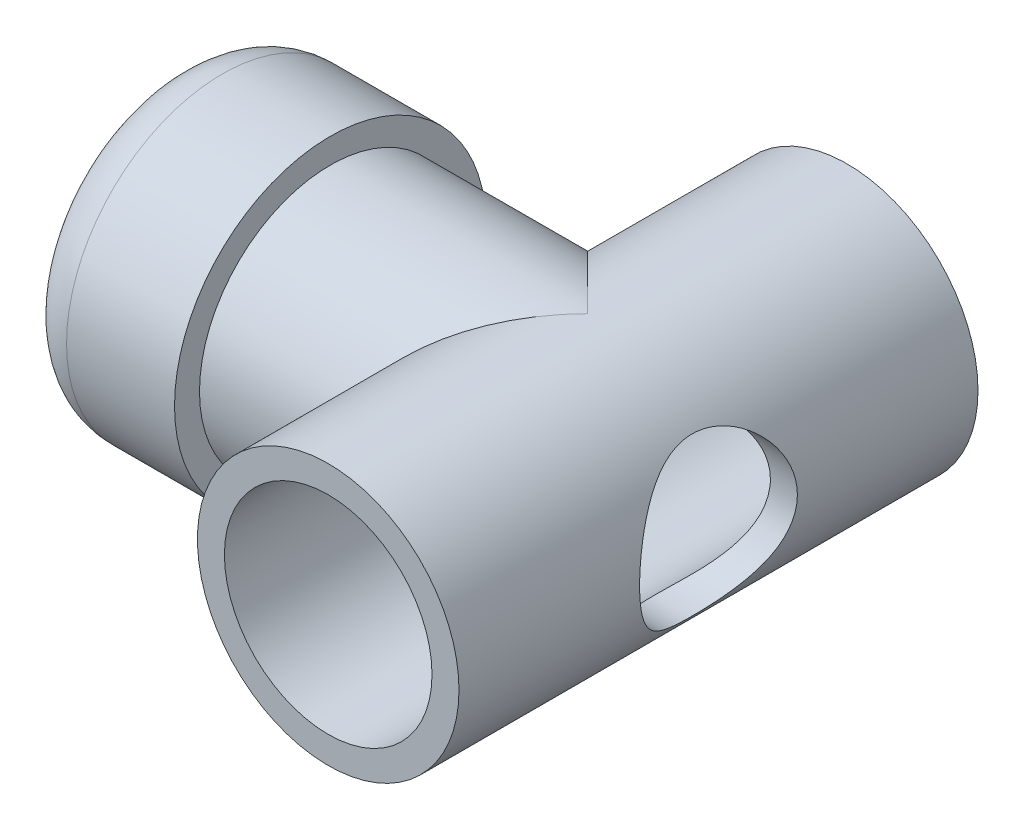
ISO-10303-21;
HEADER;
FILE_DESCRIPTION(('STEP AP214'),'2;1');
FILE_NAME('part.step','',(''),(''),'','','');
FILE_SCHEMA(('AUTOMOTIVE_DESIGN { 1 0 10303 214 1 1 1 1 }'));
ENDSEC;
DATA;
#1=APPLICATION_CONTEXT('core data for automotive mechanical design processes');
#2=APPLICATION_PROTOCOL_DEFINITION('international standard','automotive_design',2000,#1);
#3=PRODUCT_CONTEXT('',#1,'mechanical');
#4=PRODUCT('Part','Part','',(#3));
#5=PRODUCT_RELATED_PRODUCT_CATEGORY('part','',(#4));
#6=PRODUCT_DEFINITION_FORMATION('','',#4);
#7=PRODUCT_DEFINITION_CONTEXT('part definition',#1,'design');
#8=PRODUCT_DEFINITION('design','',#6,#7);
#9=PRODUCT_DEFINITION_SHAPE('','',#8);
#10=(LENGTH_UNIT() NAMED_UNIT(*) SI_UNIT(.MILLI.,.METRE.));
#11=(NAMED_UNIT(*) PLANE_ANGLE_UNIT() SI_UNIT($,.RADIAN.));
#12=(NAMED_UNIT(*) SI_UNIT($,.STERADIAN.) SOLID_ANGLE_UNIT());
#13=UNCERTAINTY_MEASURE_WITH_UNIT(LENGTH_MEASURE(1.E-05),#10,'distance_accuracy_value','');
#14=(GEOMETRIC_REPRESENTATION_CONTEXT(3) GLOBAL_UNCERTAINTY_ASSIGNED_CONTEXT((#13)) GLOBAL_UNIT_ASSIGNED_CONTEXT((#10,
#11,#12)) REPRESENTATION_CONTEXT('',''));
#15=CARTESIAN_POINT('',(0.,0.,0.));
#16=DIRECTION('',(0.,0.,1.));
#17=DIRECTION('',(1.,0.,0.));
#18=AXIS2_PLACEMENT_3D('',#15,#16,#17);
#19=CARTESIAN_POINT('',(-12.7,0.,0.));
#20=DIRECTION('',(1.,0.,0.));
#21=DIRECTION('',(0.,0.,-1.));
#22=AXIS2_PLACEMENT_3D('',#19,#20,#21);
#23=CYLINDRICAL_SURFACE('',#22,4.0005);
#24=CARTESIAN_POINT('',(0.,0.,0.));
#25=DIRECTION('',(0.707106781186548,0.,-0.707106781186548));
#26=DIRECTION('',(-0.707106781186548,0.,-0.707106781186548));
#27=AXIS2_PLACEMENT_3D('',#24,#25,#26);
#28=ELLIPSE('',#27,5.65756135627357,4.0005);
#29=CARTESIAN_POINT('',(0.,-4.0005,0.));
#30=VERTEX_POINT('',#29);
#31=CARTESIAN_POINT('',(0.,4.0005,0.));
#32=VERTEX_POINT('',#31);
#33=EDGE_CURVE('E45',#30,#32,#28,.T.);
#34=ORIENTED_EDGE('',*,*,#33,.F.);
#35=CARTESIAN_POINT('',(0.,0.,0.));
#36=DIRECTION('',(-0.707106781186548,0.,-0.707106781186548));
#37=DIRECTION('',(0.707106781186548,0.,-0.707106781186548));
#38=AXIS2_PLACEMENT_3D('',#35,#36,#37);
#39=ELLIPSE('',#38,5.65756135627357,4.0005);
#40=EDGE_CURVE('E47',#32,#30,#39,.F.);
#41=ORIENTED_EDGE('',*,*,#40,.F.);
#42=EDGE_LOOP('',(#34,#41));
#43=FACE_BOUND('',#42,.T.);
#44=CARTESIAN_POINT('',(-7.874,0.,0.));
#45=DIRECTION('',(-1.,0.,0.));
#46=DIRECTION('',(0.,0.,1.));
#47=AXIS2_PLACEMENT_3D('',#44,#45,#46);
#48=CIRCLE('',#47,4.0005);
#49=CARTESIAN_POINT('',(-7.874,0.,4.0005));
#50=VERTEX_POINT('',#49);
#51=EDGE_CURVE('E199',#50,#50,#48,.F.);
#52=ORIENTED_EDGE('',*,*,#51,.T.);
#53=EDGE_LOOP('',(#52));
#54=FACE_BOUND('',#53,.T.);
#55=ADVANCED_FACE('F30',(#43,#54),#23,.T.);
#56=CARTESIAN_POINT('',(0.,0.,7.9375));
#57=DIRECTION('',(0.,0.,-1.));
#58=DIRECTION('',(-1.,0.,0.));
#59=AXIS2_PLACEMENT_3D('',#56,#57,#58);
#60=CYLINDRICAL_SURFACE('',#59,4.0005);
#61=CARTESIAN_POINT('',(4.0005,0.,2.413));
#62=CARTESIAN_POINT('',(4.00049258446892,0.123325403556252,2.41299182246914));
#63=CARTESIAN_POINT('',(3.9947349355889,0.24684609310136,2.40347883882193));
#64=CARTESIAN_POINT('',(3.97224832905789,0.490160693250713,2.36591287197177));
#65=CARTESIAN_POINT('',(3.95549306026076,0.609944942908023,2.33781542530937));
#66=CARTESIAN_POINT('',(3.9127073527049,0.841751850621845,2.26466790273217));
#67=CARTESIAN_POINT('',(3.88672293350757,0.953809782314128,2.21970187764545));
#68=CARTESIAN_POINT('',(3.82768476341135,1.16843310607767,2.11462172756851));
#69=CARTESIAN_POINT('',(3.79463264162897,1.27100067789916,2.0545110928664));
#70=CARTESIAN_POINT('',(3.72124261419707,1.47266162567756,1.91571258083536));
#71=CARTESIAN_POINT('',(3.6805398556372,1.57088099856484,1.83595144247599));
#72=CARTESIAN_POINT('',(3.59717609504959,1.75340112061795,1.66253743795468));
#73=CARTESIAN_POINT('',(3.55451261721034,1.83768361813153,1.56886665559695));
#74=CARTESIAN_POINT('',(3.46574296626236,2.00056161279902,1.35660709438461));
#75=CARTESIAN_POINT('',(3.41986743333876,2.07715025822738,1.2363684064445));
#76=CARTESIAN_POINT('',(3.33639033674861,2.20875476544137,0.982030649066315));
#77=CARTESIAN_POINT('',(3.2987753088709,2.26380584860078,0.847954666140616));
#78=CARTESIAN_POINT('',(3.24569366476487,2.33902848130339,0.603063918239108));
#79=CARTESIAN_POINT('',(3.22706326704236,2.36443104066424,0.494544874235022));
#80=CARTESIAN_POINT('',(3.20069477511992,2.4000130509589,0.273796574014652));
#81=CARTESIAN_POINT('',(3.19294291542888,2.41021174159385,0.161572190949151));
#82=CARTESIAN_POINT('',(3.18947978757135,2.41479410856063,-0.0636201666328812));
#83=CARTESIAN_POINT('',(3.19379306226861,2.40914554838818,-0.176589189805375));
#84=CARTESIAN_POINT('',(3.21384193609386,2.38232757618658,-0.399658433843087));
#85=CARTESIAN_POINT('',(3.2295862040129,2.36114638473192,-0.509756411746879));
#86=CARTESIAN_POINT('',(3.27002066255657,2.30480607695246,-0.722787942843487));
#87=CARTESIAN_POINT('',(3.29458185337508,2.26984784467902,-0.825800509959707));
#88=CARTESIAN_POINT('',(3.34998792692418,2.18724688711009,-1.02476225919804));
#89=CARTESIAN_POINT('',(3.38083510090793,2.13959953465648,-1.12070884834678));
#90=CARTESIAN_POINT('',(3.45191363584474,2.02329181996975,-1.32079978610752));
#91=CARTESIAN_POINT('',(3.49284049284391,1.95240739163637,-1.42340458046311));
#92=CARTESIAN_POINT('',(3.57580555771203,1.79595812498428,-1.61633750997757));
#93=CARTESIAN_POINT('',(3.61784480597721,1.71037910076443,-1.70665362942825));
#94=CARTESIAN_POINT('',(3.70534621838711,1.51252036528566,-1.88549199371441));
#95=CARTESIAN_POINT('',(3.7504429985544,1.39817373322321,-1.97192627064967));
#96=CARTESIAN_POINT('',(3.83267466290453,1.15375252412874,-2.1241631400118));
#97=CARTESIAN_POINT('',(3.86981368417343,1.02368617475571,-2.18997646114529));
#98=CARTESIAN_POINT('',(3.91532291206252,0.823756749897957,-2.26908238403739));
#99=CARTESIAN_POINT('',(3.92850401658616,0.758552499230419,-2.29171713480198));
#100=CARTESIAN_POINT('',(3.95179709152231,0.625952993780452,-2.3314225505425));
#101=CARTESIAN_POINT('',(3.96191078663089,0.558558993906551,-2.34849634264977));
#102=CARTESIAN_POINT('',(3.97875267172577,0.422188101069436,-2.37679847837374));
#103=CARTESIAN_POINT('',(3.98548340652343,0.353212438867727,-2.38803121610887));
#104=CARTESIAN_POINT('',(3.99536300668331,0.214318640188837,-2.40448216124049));
#105=CARTESIAN_POINT('',(3.99851238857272,0.144400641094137,-2.40970123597));
#106=CARTESIAN_POINT('',(4.00204508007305,-0.046450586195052,-2.41556716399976));
#107=CARTESIAN_POINT('',(3.998781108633,-0.167711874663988,-2.41017825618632));
#108=CARTESIAN_POINT('',(3.98153577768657,-0.407217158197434,-2.38145326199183));
#109=CARTESIAN_POINT('',(3.96755469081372,-0.525461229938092,-2.35811763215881));
#110=CARTESIAN_POINT('',(3.93068422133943,-0.752753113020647,-2.29553185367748));
#111=CARTESIAN_POINT('',(3.90803647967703,-0.861960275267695,-2.25671227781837));
#112=CARTESIAN_POINT('',(3.85564482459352,-1.07227177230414,-2.1647153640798));
#113=CARTESIAN_POINT('',(3.82589954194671,-1.17337453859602,-2.11153525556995));
#114=CARTESIAN_POINT('',(3.75810398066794,-1.37593938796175,-1.98619737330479));
#115=CARTESIAN_POINT('',(3.71951269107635,-1.47635482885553,-1.91264478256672));
#116=CARTESIAN_POINT('',(3.63936580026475,-1.66417194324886,-1.75169248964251));
#117=CARTESIAN_POINT('',(3.59780678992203,-1.75155828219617,-1.66427671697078));
#118=CARTESIAN_POINT('',(3.50962639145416,-1.92274894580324,-1.46462259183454));
#119=CARTESIAN_POINT('',(3.46306269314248,-2.00454971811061,-1.35063026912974));
#120=CARTESIAN_POINT('',(3.37600973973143,-2.14793017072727,-1.10847258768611));
#121=CARTESIAN_POINT('',(3.33551435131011,-2.2095303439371,-0.980321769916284));
#122=CARTESIAN_POINT('',(3.27421527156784,-2.29908796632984,-0.741186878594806));
#123=CARTESIAN_POINT('',(3.25104834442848,-2.33143561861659,-0.632459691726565));
#124=CARTESIAN_POINT('',(3.21519627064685,-2.3806426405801,-0.409938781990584));
#125=CARTESIAN_POINT('',(3.20249632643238,-2.39752387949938,-0.296152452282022));
#126=CARTESIAN_POINT('',(3.18945011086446,-2.41485825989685,-0.0661378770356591));
#127=CARTESIAN_POINT('',(3.189153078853,-2.41524592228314,0.0500982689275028));
#128=CARTESIAN_POINT('',(3.20109105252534,-2.39939642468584,0.280802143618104));
#129=CARTESIAN_POINT('',(3.21333264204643,-2.38315053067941,0.395268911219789));
#130=CARTESIAN_POINT('',(3.24753302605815,-2.33630080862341,0.61323889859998));
#131=CARTESIAN_POINT('',(3.26895329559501,-2.30648771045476,0.717002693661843));
#132=CARTESIAN_POINT('',(3.31886637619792,-2.23406654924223,0.918125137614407));
#133=CARTESIAN_POINT('',(3.34736186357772,-2.19145364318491,1.01548134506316));
#134=CARTESIAN_POINT('',(3.41351545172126,-2.08716913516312,1.21698907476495));
#135=CARTESIAN_POINT('',(3.45190832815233,-2.02357979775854,1.31990401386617));
#136=CARTESIAN_POINT('',(3.53094763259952,-1.88227780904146,1.51462458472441));
#137=CARTESIAN_POINT('',(3.57159590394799,-1.80455348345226,1.60642092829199));
#138=CARTESIAN_POINT('',(3.65858977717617,-1.62191127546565,1.79211152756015));
#139=CARTESIAN_POINT('',(3.70474759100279,-1.51461888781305,1.8837757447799));
#140=CARTESIAN_POINT('',(3.79089930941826,-1.28382326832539,2.04801741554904));
#141=CARTESIAN_POINT('',(3.83089082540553,-1.16031378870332,2.12058748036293));
#142=CARTESIAN_POINT('',(3.88245008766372,-0.966908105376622,2.21191849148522));
#143=CARTESIAN_POINT('',(3.89807746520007,-0.901996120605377,2.23918985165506));
#144=CARTESIAN_POINT('',(3.9263819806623,-0.769480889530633,2.28810963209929));
#145=CARTESIAN_POINT('',(3.93906083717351,-0.701879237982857,2.30976132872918));
#146=CARTESIAN_POINT('',(3.96104776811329,-0.56472450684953,2.34706065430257));
#147=CARTESIAN_POINT('',(3.97036559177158,-0.495177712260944,2.36272565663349));
#148=CARTESIAN_POINT('',(3.98537634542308,-0.354628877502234,2.38786428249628));
#149=CARTESIAN_POINT('',(3.99107225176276,-0.283628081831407,2.39734298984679));
#150=CARTESIAN_POINT('',(3.99673813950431,-0.177011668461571,2.40675921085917));
#151=CARTESIAN_POINT('',(3.99814708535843,-0.141666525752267,2.40909768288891));
#152=CARTESIAN_POINT('',(4.000029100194,-0.0708863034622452,2.41221928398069));
#153=CARTESIAN_POINT('',(4.00050213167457,-0.0354512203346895,2.41300235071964));
#154=CARTESIAN_POINT('',(4.0005,0.,2.413));
#155=B_SPLINE_CURVE_WITH_KNOTS('',3,(#61,#62,#63,#64,#65,#66,#67,#68,#69,#70,#71,#72,#73,#74,
#75,#76,#77,#78,#79,#80,#81,#82,#83,#84,#85,#86,#87,#88,#89,#90,#91,#92,#93,#94,#95,#96,#97,#98,
#99,#100,#101,#102,#103,#104,#105,#106,#107,#108,#109,#110,#111,#112,#113,#114,#115,#116,#117,
#118,#119,#120,#121,#122,#123,#124,#125,#126,#127,#128,#129,#130,#131,#132,#133,#134,#135,#136,
#137,#138,#139,#140,#141,#142,#143,#144,#145,#146,#147,#148,#149,#150,#151,#152,#153,#154),
.UNSPECIFIED.,.T.,.F.,(4,2,2,2,2,2,2,2,2,2,2,2,2,2,2,2,2,2,2,2,2,2,2,2,2,2,2,2,2,2,2,2,2,2,2,2,
2,2,2,2,2,2,2,2,2,2,4),(0.,0.369832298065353,0.740552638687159,1.109449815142,1.47826205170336,
1.87544155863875,2.27313715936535,2.72023274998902,3.16659409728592,3.5041586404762,
3.84129564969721,4.17911896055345,4.51719873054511,4.85052121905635,5.18396542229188,
5.57623012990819,5.96887567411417,6.41744980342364,6.86579015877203,7.07633174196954,
7.2867547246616,7.49701918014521,7.70725330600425,8.06951937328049,8.4317762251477,
8.78459281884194,9.13747753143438,9.52689942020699,9.91677607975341,10.3582349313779,
10.799244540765,11.1451590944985,11.4905837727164,11.8373796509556,12.1843577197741,
12.5132888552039,12.8423446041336,13.2217065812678,13.6013833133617,14.044735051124,
14.4882580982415,14.7043511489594,14.9203179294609,15.1356531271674,15.350811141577,
15.4571191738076,15.5634314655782),.UNSPECIFIED.);
#156=CARTESIAN_POINT('',(4.0005,0.,2.413));
#157=VERTEX_POINT('',#156);
#158=EDGE_CURVE('E82',#157,#157,#155,.T.);
#159=ORIENTED_EDGE('',*,*,#158,.T.);
#160=EDGE_LOOP('',(#159));
#161=FACE_BOUND('',#160,.T.);
#162=ORIENTED_EDGE('',*,*,#40,.T.);
#163=ORIENTED_EDGE('',*,*,#33,.T.);
#164=EDGE_LOOP('',(#162,#163));
#165=FACE_BOUND('',#164,.T.);
#166=CARTESIAN_POINT('',(0.,0.,7.9375));
#167=DIRECTION('',(0.,0.,1.));
#168=DIRECTION('',(1.,0.,0.));
#169=AXIS2_PLACEMENT_3D('',#166,#167,#168);
#170=CIRCLE('',#169,4.0005);
#171=CARTESIAN_POINT('',(4.0005,0.,7.9375));
#172=VERTEX_POINT('',#171);
#173=EDGE_CURVE('E50',#172,#172,#170,.T.);
#174=ORIENTED_EDGE('',*,*,#173,.F.);
#175=EDGE_LOOP('',(#174));
#176=FACE_BOUND('',#175,.T.);
#177=CARTESIAN_POINT('',(0.,0.,-7.9375));
#178=DIRECTION('',(0.,0.,1.));
#179=DIRECTION('',(1.,0.,0.));
#180=AXIS2_PLACEMENT_3D('',#177,#178,#179);
#181=CIRCLE('',#180,4.0005);
#182=CARTESIAN_POINT('',(4.0005,0.,-7.9375));
#183=VERTEX_POINT('',#182);
#184=EDGE_CURVE('E95',#183,#183,#181,.T.);
#185=ORIENTED_EDGE('',*,*,#184,.T.);
#186=EDGE_LOOP('',(#185));
#187=FACE_BOUND('',#186,.T.);
#188=ADVANCED_FACE('F32',(#161,#165,#176,#187),#60,.T.);
#189=CARTESIAN_POINT('',(0.,0.,7.9375));
#190=DIRECTION('',(0.,0.,1.));
#191=DIRECTION('',(1.,0.,0.));
#192=AXIS2_PLACEMENT_3D('',#189,#190,#191);
#193=PLANE('',#192);
#194=CARTESIAN_POINT('',(0.,0.,7.9375));
#195=DIRECTION('',(0.,0.,1.));
#196=DIRECTION('',(1.,0.,0.));
#197=AXIS2_PLACEMENT_3D('',#194,#195,#196);
#198=CIRCLE('',#197,3.175);
#199=CARTESIAN_POINT('',(3.175,0.,7.9375));
#200=VERTEX_POINT('',#199);
#201=EDGE_CURVE('E88',#200,#200,#198,.T.);
#202=ORIENTED_EDGE('',*,*,#201,.F.);
#203=EDGE_LOOP('',(#202));
#204=FACE_BOUND('',#203,.T.);
#205=ORIENTED_EDGE('',*,*,#173,.T.);
#206=EDGE_LOOP('',(#205));
#207=FACE_BOUND('',#206,.T.);
#208=ADVANCED_FACE('F100',(#204,#207),#193,.T.);
#209=CARTESIAN_POINT('',(0.,0.,-7.9375));
#210=DIRECTION('',(0.,0.,1.));
#211=DIRECTION('',(1.,0.,0.));
#212=AXIS2_PLACEMENT_3D('',#209,#210,#211);
#213=PLANE('',#212);
#214=CARTESIAN_POINT('',(0.,0.,-7.9375));
#215=DIRECTION('',(0.,0.,1.));
#216=DIRECTION('',(1.,0.,0.));
#217=AXIS2_PLACEMENT_3D('',#214,#215,#216);
#218=CIRCLE('',#217,3.175);
#219=CARTESIAN_POINT('',(3.175,0.,-7.9375));
#220=VERTEX_POINT('',#219);
#221=EDGE_CURVE('E92',#220,#220,#218,.T.);
#222=ORIENTED_EDGE('',*,*,#221,.T.);
#223=EDGE_LOOP('',(#222));
#224=FACE_BOUND('',#223,.T.);
#225=ORIENTED_EDGE('',*,*,#184,.F.);
#226=EDGE_LOOP('',(#225));
#227=FACE_BOUND('',#226,.T.);
#228=ADVANCED_FACE('F106',(#224,#227),#213,.F.);
#229=CARTESIAN_POINT('',(-12.7,0.,0.));
#230=DIRECTION('',(1.,0.,0.));
#231=DIRECTION('',(0.,0.,-1.));
#232=AXIS2_PLACEMENT_3D('',#229,#230,#231);
#233=PLANE('',#232);
#234=CARTESIAN_POINT('',(-12.7,0.,0.));
#235=DIRECTION('',(1.,0.,0.));
#236=DIRECTION('',(0.,0.,-1.));
#237=AXIS2_PLACEMENT_3D('',#234,#235,#236);
#238=CIRCLE('',#237,3.24059156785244);
#239=CARTESIAN_POINT('',(-12.7,0.,-3.24059156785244));
#240=VERTEX_POINT('',#239);
#241=EDGE_CURVE('E39',#240,#240,#238,.F.);
#242=ORIENTED_EDGE('',*,*,#241,.T.);
#243=EDGE_LOOP('',(#242));
#244=FACE_BOUND('',#243,.T.);
#245=CARTESIAN_POINT('',(-12.7,0.,0.));
#246=DIRECTION('',(-1.,0.,0.));
#247=DIRECTION('',(0.,0.,1.));
#248=AXIS2_PLACEMENT_3D('',#245,#246,#247);
#249=CIRCLE('',#248,2.413);
#250=CARTESIAN_POINT('',(-12.7,0.,2.413));
#251=VERTEX_POINT('',#250);
#252=EDGE_CURVE('E65',#251,#251,#249,.T.);
#253=ORIENTED_EDGE('',*,*,#252,.F.);
#254=EDGE_LOOP('',(#253));
#255=FACE_BOUND('',#254,.T.);
#256=ADVANCED_FACE('F108',(#244,#255),#233,.F.);
#257=CARTESIAN_POINT('',(0.,0.,-7.9375));
#258=DIRECTION('',(0.,0.,1.));
#259=DIRECTION('',(1.,0.,0.));
#260=AXIS2_PLACEMENT_3D('',#257,#258,#259);
#261=CYLINDRICAL_SURFACE('',#260,3.175);
#262=CARTESIAN_POINT('',(3.175,0.,-2.413));
#263=CARTESIAN_POINT('',(3.17499092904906,0.117443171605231,-2.41299058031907));
#264=CARTESIAN_POINT('',(3.16841692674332,0.23503818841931,-2.40435818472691));
#265=CARTESIAN_POINT('',(3.14271336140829,0.466484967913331,-2.37038175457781));
#266=CARTESIAN_POINT('',(3.12355818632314,0.580328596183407,-2.34500362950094));
#267=CARTESIAN_POINT('',(3.07452724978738,0.80033693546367,-2.27928432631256));
#268=CARTESIAN_POINT('',(3.04471549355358,0.906543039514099,-2.23903243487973));
#269=CARTESIAN_POINT('',(2.97659455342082,1.10997011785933,-2.14548015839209));
#270=CARTESIAN_POINT('',(2.93828675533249,1.20719255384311,-2.09218190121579));
#271=CARTESIAN_POINT('',(2.85170030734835,1.40022726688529,-1.96882085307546));
#272=CARTESIAN_POINT('',(2.80282512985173,1.49506365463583,-1.89765858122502));
#273=CARTESIAN_POINT('',(2.7008760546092,1.67223382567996,-1.7435641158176));
#274=CARTESIAN_POINT('',(2.64779595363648,1.75454859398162,-1.66061438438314));
#275=CARTESIAN_POINT('',(2.5296135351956,1.92203888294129,-1.46565859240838));
#276=CARTESIAN_POINT('',(2.4643124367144,2.00423140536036,-1.35120048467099));
#277=CARTESIAN_POINT('',(2.33951215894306,2.14857118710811,-1.10735736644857));
#278=CARTESIAN_POINT('',(2.28000569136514,2.21074385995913,-0.977991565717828));
#279=CARTESIAN_POINT('',(2.19490180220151,2.29462037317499,-0.752497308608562));
#280=CARTESIAN_POINT('',(2.16472241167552,2.32287346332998,-0.660558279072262));
#281=CARTESIAN_POINT('',(2.11470881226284,2.36849823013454,-0.471390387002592));
#282=CARTESIAN_POINT('',(2.09485053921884,2.38589523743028,-0.374174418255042));
#283=CARTESIAN_POINT('',(2.06860028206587,2.40870358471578,-0.175460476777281));
#284=CARTESIAN_POINT('',(2.06234200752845,2.4139959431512,-0.0739299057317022));
#285=CARTESIAN_POINT('',(2.06503422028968,2.41169213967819,0.128798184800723));
#286=CARTESIAN_POINT('',(2.07398814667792,2.40409306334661,0.229995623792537));
#287=CARTESIAN_POINT('',(2.10340433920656,2.37836508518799,0.416917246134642));
#288=CARTESIAN_POINT('',(2.1224091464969,2.36156171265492,0.503073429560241));
#289=CARTESIAN_POINT('',(2.16837457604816,2.31942910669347,0.671064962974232));
#290=CARTESIAN_POINT('',(2.19534332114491,2.29409116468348,0.752895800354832));
#291=CARTESIAN_POINT('',(2.27376916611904,2.21702947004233,0.962631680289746));
#292=CARTESIAN_POINT('',(2.32983777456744,2.15880606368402,1.08642083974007));
#293=CARTESIAN_POINT('',(2.44783368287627,2.02405846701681,1.32063556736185));
#294=CARTESIAN_POINT('',(2.50977535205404,1.94748865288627,1.43102676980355));
#295=CARTESIAN_POINT('',(2.63500191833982,1.77457755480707,1.64086400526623));
#296=CARTESIAN_POINT('',(2.69827393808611,1.67772908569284,1.73990181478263));
#297=CARTESIAN_POINT('',(2.81868720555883,1.46641465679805,1.92133244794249));
#298=CARTESIAN_POINT('',(2.87583967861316,1.35198192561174,2.00375600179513));
#299=CARTESIAN_POINT('',(2.96897239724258,1.1302184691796,2.13504920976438));
#300=CARTESIAN_POINT('',(3.00691100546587,1.02573469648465,2.18732233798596));
#301=CARTESIAN_POINT('',(3.07269924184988,0.807524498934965,2.27691743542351));
#302=CARTESIAN_POINT('',(3.10055488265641,0.693803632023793,2.31424831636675));
#303=CARTESIAN_POINT('',(3.14392869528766,0.458986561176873,2.37204565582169));
#304=CARTESIAN_POINT('',(3.15936426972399,0.337846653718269,2.39239924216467));
#305=CARTESIAN_POINT('',(3.17600778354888,0.0929212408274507,2.41433718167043));
#306=CARTESIAN_POINT('',(3.17722319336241,-0.0308628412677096,2.41593138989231));
#307=CARTESIAN_POINT('',(3.16598164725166,-0.263113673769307,2.40112430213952));
#308=CARTESIAN_POINT('',(3.15499411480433,-0.37178489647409,2.38665711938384));
#309=CARTESIAN_POINT('',(3.12256258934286,-0.584657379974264,2.34361709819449));
#310=CARTESIAN_POINT('',(3.10111659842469,-0.688857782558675,2.31504156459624));
#311=CARTESIAN_POINT('',(3.04866013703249,-0.893151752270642,2.24429284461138));
#312=CARTESIAN_POINT('',(3.01741404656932,-0.993066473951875,2.20178337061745));
#313=CARTESIAN_POINT('',(2.94762615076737,-1.18427030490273,2.10512741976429));
#314=CARTESIAN_POINT('',(2.90908324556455,-1.27555811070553,2.05097918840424));
#315=CARTESIAN_POINT('',(2.82008518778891,-1.4629408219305,1.92283493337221));
#316=CARTESIAN_POINT('',(2.76871323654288,-1.55736336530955,1.84703979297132));
#317=CARTESIAN_POINT('',(2.66229345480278,-1.7330266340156,1.68334400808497));
#318=CARTESIAN_POINT('',(2.60723836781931,-1.81424018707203,1.59541908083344));
#319=CARTESIAN_POINT('',(2.51929011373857,-1.93310120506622,1.44596227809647));
#320=CARTESIAN_POINT('',(2.48634042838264,-1.97518148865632,1.38794003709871));
#321=CARTESIAN_POINT('',(2.42143291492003,-2.05424288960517,1.26799956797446));
#322=CARTESIAN_POINT('',(2.38947544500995,-2.09122218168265,1.2060799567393));
#323=CARTESIAN_POINT('',(2.29677780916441,-2.19405069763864,1.01470921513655));
#324=CARTESIAN_POINT('',(2.2389759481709,-2.25209423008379,0.879267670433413));
#325=CARTESIAN_POINT('',(2.16148731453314,-2.32600727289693,0.648667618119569));
#326=CARTESIAN_POINT('',(2.13568591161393,-2.34951337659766,0.557995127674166));
#327=CARTESIAN_POINT('',(2.09487284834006,-2.38597736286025,0.372275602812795));
#328=CARTESIAN_POINT('',(2.0798354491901,-2.39896041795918,0.277239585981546));
#329=CARTESIAN_POINT('',(2.06298898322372,-2.41347202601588,0.0843820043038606));
#330=CARTESIAN_POINT('',(2.06127434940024,-2.41491881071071,-0.0134545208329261));
#331=CARTESIAN_POINT('',(2.07166816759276,-2.40600289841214,-0.207882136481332));
#332=CARTESIAN_POINT('',(2.08379036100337,-2.39562846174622,-0.30447189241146));
#333=CARTESIAN_POINT('',(2.12256830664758,-2.36137219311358,-0.508834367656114));
#334=CARTESIAN_POINT('',(2.15126142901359,-2.33557340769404,-0.615881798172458));
#335=CARTESIAN_POINT('',(2.21923176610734,-2.27108364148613,-0.822515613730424));
#336=CARTESIAN_POINT('',(2.25853638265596,-2.2323592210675,-0.922081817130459));
#337=CARTESIAN_POINT('',(2.35955877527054,-2.12610942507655,-1.1505330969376));
#338=CARTESIAN_POINT('',(2.42403799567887,-2.05324191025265,-1.27569998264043));
#339=CARTESIAN_POINT('',(2.55539518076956,-1.88728411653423,-1.5104318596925));
#340=CARTESIAN_POINT('',(2.62227580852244,-1.79417076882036,-1.61997881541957));
#341=CARTESIAN_POINT('',(2.75272337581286,-1.58693666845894,-1.82362287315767));
#342=CARTESIAN_POINT('',(2.81622750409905,-1.47252844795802,-1.9174704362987));
#343=CARTESIAN_POINT('',(2.93245405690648,-1.22472214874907,-2.0844185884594));
#344=CARTESIAN_POINT('',(2.9852011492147,-1.09136873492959,-2.15756679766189));
#345=CARTESIAN_POINT('',(3.06143310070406,-0.848324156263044,-2.26167625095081));
#346=CARTESIAN_POINT('',(3.08897584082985,-0.742491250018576,-2.29871569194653));
#347=CARTESIAN_POINT('',(3.13329848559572,-0.524711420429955,-2.35794338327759));
#348=CARTESIAN_POINT('',(3.1501052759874,-0.41278053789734,-2.38016873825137));
#349=CARTESIAN_POINT('',(3.16554486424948,-0.249887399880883,-2.40054788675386));
#350=CARTESIAN_POINT('',(3.16908209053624,-0.200104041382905,-2.40520884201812));
#351=CARTESIAN_POINT('',(3.17381185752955,-0.10022305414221,-2.41143725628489));
#352=CARTESIAN_POINT('',(3.17500387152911,-0.0501253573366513,-2.41300402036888));
#353=CARTESIAN_POINT('',(3.175,0.,-2.413));
#354=B_SPLINE_CURVE_WITH_KNOTS('',3,(#262,#263,#264,#265,#266,#267,#268,#269,#270,#271,#272,
#273,#274,#275,#276,#277,#278,#279,#280,#281,#282,#283,#284,#285,#286,#287,#288,#289,#290,#291,
#292,#293,#294,#295,#296,#297,#298,#299,#300,#301,#302,#303,#304,#305,#306,#307,#308,#309,#310,
#311,#312,#313,#314,#315,#316,#317,#318,#319,#320,#321,#322,#323,#324,#325,#326,#327,#328,#329,
#330,#331,#332,#333,#334,#335,#336,#337,#338,#339,#340,#341,#342,#343,#344,#345,#346,#347,#348,
#349,#350,#351,#352,#353),.UNSPECIFIED.,.T.,.F.,(4,2,2,2,2,2,2,2,2,2,2,2,2,2,2,2,2,2,2,2,2,2,2,
2,2,2,2,2,2,2,2,2,2,2,2,2,2,2,2,2,2,2,2,2,2,4),(0.,0.352113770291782,0.704946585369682,
1.05569488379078,1.40638601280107,1.78976092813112,2.17371233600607,2.63773050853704,
3.10115730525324,3.40258553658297,3.70330778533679,4.00697348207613,4.31070783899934,
4.57916413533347,4.84789519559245,5.28900480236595,5.73122295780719,6.18621377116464,
6.64035513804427,7.00739894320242,7.37422351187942,7.74346787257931,8.11251824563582,
8.4415189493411,8.77058252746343,9.10825790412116,9.44598421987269,9.83917081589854,
10.2331562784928,10.469557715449,10.7060435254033,11.1774135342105,11.4679029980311,
11.757695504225,12.0495402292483,12.3416750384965,12.6811651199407,13.0215403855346,
13.4947220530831,13.9684457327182,14.4491015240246,14.9286423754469,15.2736416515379,
15.6177735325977,15.768023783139,15.9183077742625),.UNSPECIFIED.);
#355=CARTESIAN_POINT('',(3.175,0.,-2.413));
#356=VERTEX_POINT('',#355);
#357=EDGE_CURVE('E64',#356,#356,#354,.T.);
#358=ORIENTED_EDGE('',*,*,#357,.T.);
#359=EDGE_LOOP('',(#358));
#360=FACE_BOUND('',#359,.T.);
#361=CARTESIAN_POINT('',(-3.175,0.,2.413));
#362=CARTESIAN_POINT('',(-3.17499092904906,0.117443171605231,2.41299058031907));
#363=CARTESIAN_POINT('',(-3.16841692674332,0.23503818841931,2.40435818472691));
#364=CARTESIAN_POINT('',(-3.14271336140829,0.466484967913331,2.37038175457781));
#365=CARTESIAN_POINT('',(-3.12355818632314,0.580328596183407,2.34500362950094));
#366=CARTESIAN_POINT('',(-3.07452724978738,0.80033693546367,2.27928432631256));
#367=CARTESIAN_POINT('',(-3.04471549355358,0.906543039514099,2.23903243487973));
#368=CARTESIAN_POINT('',(-2.97659455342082,1.10997011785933,2.14548015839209));
#369=CARTESIAN_POINT('',(-2.93828675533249,1.20719255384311,2.09218190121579));
#370=CARTESIAN_POINT('',(-2.85170030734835,1.40022726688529,1.96882085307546));
#371=CARTESIAN_POINT('',(-2.80282512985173,1.49506365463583,1.89765858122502));
#372=CARTESIAN_POINT('',(-2.7008760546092,1.67223382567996,1.7435641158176));
#373=CARTESIAN_POINT('',(-2.64779595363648,1.75454859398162,1.66061438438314));
#374=CARTESIAN_POINT('',(-2.5296135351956,1.92203888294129,1.46565859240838));
#375=CARTESIAN_POINT('',(-2.4643124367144,2.00423140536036,1.35120048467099));
#376=CARTESIAN_POINT('',(-2.33951215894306,2.14857118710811,1.10735736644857));
#377=CARTESIAN_POINT('',(-2.28000569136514,2.21074385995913,0.977991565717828));
#378=CARTESIAN_POINT('',(-2.19490180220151,2.29462037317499,0.752497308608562));
#379=CARTESIAN_POINT('',(-2.16472241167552,2.32287346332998,0.660558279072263));
#380=CARTESIAN_POINT('',(-2.11470881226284,2.36849823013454,0.471390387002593));
#381=CARTESIAN_POINT('',(-2.09485053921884,2.38589523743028,0.374174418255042));
#382=CARTESIAN_POINT('',(-2.06860028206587,2.40870358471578,0.175460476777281));
#383=CARTESIAN_POINT('',(-2.06234200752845,2.4139959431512,0.0739299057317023));
#384=CARTESIAN_POINT('',(-2.06503422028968,2.41169213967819,-0.128798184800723));
#385=CARTESIAN_POINT('',(-2.07398814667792,2.40409306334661,-0.229995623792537));
#386=CARTESIAN_POINT('',(-2.10340433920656,2.37836508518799,-0.416917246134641));
#387=CARTESIAN_POINT('',(-2.1224091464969,2.36156171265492,-0.503073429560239));
#388=CARTESIAN_POINT('',(-2.16837457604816,2.31942910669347,-0.671064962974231));
#389=CARTESIAN_POINT('',(-2.19534332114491,2.29409116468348,-0.752895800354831));
#390=CARTESIAN_POINT('',(-2.27376916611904,2.21702947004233,-0.962631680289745));
#391=CARTESIAN_POINT('',(-2.32983777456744,2.15880606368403,-1.08642083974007));
#392=CARTESIAN_POINT('',(-2.44783368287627,2.02405846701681,-1.32063556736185));
#393=CARTESIAN_POINT('',(-2.50977535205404,1.94748865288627,-1.43102676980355));
#394=CARTESIAN_POINT('',(-2.63500191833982,1.77457755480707,-1.64086400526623));
#395=CARTESIAN_POINT('',(-2.69827393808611,1.67772908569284,-1.73990181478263));
#396=CARTESIAN_POINT('',(-2.81868720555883,1.46641465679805,-1.92133244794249));
#397=CARTESIAN_POINT('',(-2.87583967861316,1.35198192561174,-2.00375600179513));
#398=CARTESIAN_POINT('',(-2.96897239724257,1.1302184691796,-2.13504920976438));
#399=CARTESIAN_POINT('',(-3.00691100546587,1.02573469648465,-2.18732233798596));
#400=CARTESIAN_POINT('',(-3.07269924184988,0.807524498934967,-2.27691743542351));
#401=CARTESIAN_POINT('',(-3.10055488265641,0.693803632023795,-2.31424831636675));
#402=CARTESIAN_POINT('',(-3.14392869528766,0.458986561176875,-2.37204565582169));
#403=CARTESIAN_POINT('',(-3.15936426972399,0.337846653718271,-2.39239924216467));
#404=CARTESIAN_POINT('',(-3.17600778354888,0.0929212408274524,-2.41433718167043));
#405=CARTESIAN_POINT('',(-3.17722319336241,-0.0308628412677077,-2.41593138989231));
#406=CARTESIAN_POINT('',(-3.16598164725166,-0.263113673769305,-2.40112430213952));
#407=CARTESIAN_POINT('',(-3.15499411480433,-0.371784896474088,-2.38665711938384));
#408=CARTESIAN_POINT('',(-3.12256258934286,-0.584657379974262,-2.34361709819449));
#409=CARTESIAN_POINT('',(-3.10111659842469,-0.688857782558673,-2.31504156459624));
#410=CARTESIAN_POINT('',(-3.04866013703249,-0.89315175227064,-2.24429284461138));
#411=CARTESIAN_POINT('',(-3.01741404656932,-0.993066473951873,-2.20178337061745));
#412=CARTESIAN_POINT('',(-2.94762615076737,-1.18427030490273,-2.10512741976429));
#413=CARTESIAN_POINT('',(-2.90908324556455,-1.27555811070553,-2.05097918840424));
#414=CARTESIAN_POINT('',(-2.82008518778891,-1.4629408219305,-1.92283493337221));
#415=CARTESIAN_POINT('',(-2.76871323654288,-1.55736336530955,-1.84703979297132));
#416=CARTESIAN_POINT('',(-2.66229345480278,-1.7330266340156,-1.68334400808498));
#417=CARTESIAN_POINT('',(-2.60723836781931,-1.81424018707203,-1.59541908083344));
#418=CARTESIAN_POINT('',(-2.51929011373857,-1.93310120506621,-1.44596227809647));
#419=CARTESIAN_POINT('',(-2.48634042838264,-1.97518148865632,-1.38794003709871));
#420=CARTESIAN_POINT('',(-2.42143291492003,-2.05424288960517,-1.26799956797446));
#421=CARTESIAN_POINT('',(-2.38947544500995,-2.09122218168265,-1.2060799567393));
#422=CARTESIAN_POINT('',(-2.29677780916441,-2.19405069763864,-1.01470921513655));
#423=CARTESIAN_POINT('',(-2.2389759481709,-2.25209423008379,-0.879267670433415));
#424=CARTESIAN_POINT('',(-2.16148731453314,-2.32600727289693,-0.648667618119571));
#425=CARTESIAN_POINT('',(-2.13568591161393,-2.34951337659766,-0.557995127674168));
#426=CARTESIAN_POINT('',(-2.09487284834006,-2.38597736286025,-0.372275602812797));
#427=CARTESIAN_POINT('',(-2.0798354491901,-2.39896041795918,-0.277239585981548));
#428=CARTESIAN_POINT('',(-2.06298898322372,-2.41347202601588,-0.0843820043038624));
#429=CARTESIAN_POINT('',(-2.06127434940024,-2.41491881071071,0.0134545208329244));
#430=CARTESIAN_POINT('',(-2.07166816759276,-2.40600289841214,0.20788213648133));
#431=CARTESIAN_POINT('',(-2.08379036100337,-2.39562846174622,0.304471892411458));
#432=CARTESIAN_POINT('',(-2.12256830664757,-2.36137219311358,0.508834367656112));
#433=CARTESIAN_POINT('',(-2.15126142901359,-2.33557340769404,0.615881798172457));
#434=CARTESIAN_POINT('',(-2.21923176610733,-2.27108364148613,0.822515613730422));
#435=CARTESIAN_POINT('',(-2.25853638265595,-2.2323592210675,0.922081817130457));
#436=CARTESIAN_POINT('',(-2.35955877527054,-2.12610942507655,1.15053309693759));
#437=CARTESIAN_POINT('',(-2.42403799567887,-2.05324191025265,1.27569998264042));
#438=CARTESIAN_POINT('',(-2.55539518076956,-1.88728411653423,1.5104318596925));
#439=CARTESIAN_POINT('',(-2.62227580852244,-1.79417076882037,1.61997881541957));
#440=CARTESIAN_POINT('',(-2.75272337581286,-1.58693666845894,1.82362287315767));
#441=CARTESIAN_POINT('',(-2.81622750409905,-1.47252844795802,1.9174704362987));
#442=CARTESIAN_POINT('',(-2.93245405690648,-1.22472214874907,2.0844185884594));
#443=CARTESIAN_POINT('',(-2.98520114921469,-1.09136873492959,2.15756679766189));
#444=CARTESIAN_POINT('',(-3.06143310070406,-0.848324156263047,2.26167625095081));
#445=CARTESIAN_POINT('',(-3.08897584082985,-0.74249125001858,2.29871569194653));
#446=CARTESIAN_POINT('',(-3.13329848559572,-0.524711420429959,2.35794338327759));
#447=CARTESIAN_POINT('',(-3.1501052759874,-0.412780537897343,2.38016873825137));
#448=CARTESIAN_POINT('',(-3.16554486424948,-0.249887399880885,2.40054788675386));
#449=CARTESIAN_POINT('',(-3.16908209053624,-0.200104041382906,2.40520884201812));
#450=CARTESIAN_POINT('',(-3.17381185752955,-0.10022305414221,2.41143725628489));
#451=CARTESIAN_POINT('',(-3.17500387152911,-0.0501253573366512,2.41300402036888));
#452=CARTESIAN_POINT('',(-3.175,0.,2.413));
#453=B_SPLINE_CURVE_WITH_KNOTS('',3,(#361,#362,#363,#364,#365,#366,#367,#368,#369,#370,#371,
#372,#373,#374,#375,#376,#377,#378,#379,#380,#381,#382,#383,#384,#385,#386,#387,#388,#389,#390,
#391,#392,#393,#394,#395,#396,#397,#398,#399,#400,#401,#402,#403,#404,#405,#406,#407,#408,#409,
#410,#411,#412,#413,#414,#415,#416,#417,#418,#419,#420,#421,#422,#423,#424,#425,#426,#427,#428,
#429,#430,#431,#432,#433,#434,#435,#436,#437,#438,#439,#440,#441,#442,#443,#444,#445,#446,#447,
#448,#449,#450,#451,#452),.UNSPECIFIED.,.T.,.F.,(4,2,2,2,2,2,2,2,2,2,2,2,2,2,2,2,2,2,2,2,2,2,2,
2,2,2,2,2,2,2,2,2,2,2,2,2,2,2,2,2,2,2,2,2,2,4),(0.,0.352113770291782,0.704946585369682,
1.05569488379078,1.40638601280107,1.78976092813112,2.17371233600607,2.63773050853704,
3.10115730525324,3.40258553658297,3.70330778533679,4.00697348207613,4.31070783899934,
4.57916413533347,4.84789519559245,5.28900480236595,5.73122295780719,6.18621377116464,
6.64035513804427,7.00739894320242,7.37422351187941,7.74346787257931,8.11251824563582,
8.44151894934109,8.77058252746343,9.10825790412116,9.44598421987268,9.83917081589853,
10.2331562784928,10.469557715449,10.7060435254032,11.1774135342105,11.4679029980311,
11.757695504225,12.0495402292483,12.3416750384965,12.6811651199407,13.0215403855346,
13.4947220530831,13.9684457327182,14.4491015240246,14.9286423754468,15.2736416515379,
15.6177735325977,15.768023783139,15.9183077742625),.UNSPECIFIED.);
#454=CARTESIAN_POINT('',(-3.175,0.,2.413));
#455=VERTEX_POINT('',#454);
#456=EDGE_CURVE('E57',#455,#455,#453,.T.);
#457=ORIENTED_EDGE('',*,*,#456,.T.);
#458=EDGE_LOOP('',(#457));
#459=FACE_BOUND('',#458,.T.);
#460=ORIENTED_EDGE('',*,*,#221,.F.);
#461=EDGE_LOOP('',(#460));
#462=FACE_BOUND('',#461,.T.);
#463=ORIENTED_EDGE('',*,*,#201,.T.);
#464=EDGE_LOOP('',(#463));
#465=FACE_BOUND('',#464,.T.);
#466=ADVANCED_FACE('F68',(#360,#459,#462,#465),#261,.F.);
#467=CARTESIAN_POINT('',(4.0005,0.,0.));
#468=DIRECTION('',(-1.,0.,0.));
#469=DIRECTION('',(0.,0.,1.));
#470=AXIS2_PLACEMENT_3D('',#467,#468,#469);
#471=CYLINDRICAL_SURFACE('',#470,2.413);
#472=ORIENTED_EDGE('',*,*,#252,.T.);
#473=EDGE_LOOP('',(#472));
#474=FACE_BOUND('',#473,.T.);
#475=ORIENTED_EDGE('',*,*,#456,.F.);
#476=EDGE_LOOP('',(#475));
#477=FACE_BOUND('',#476,.T.);
#478=ADVANCED_FACE('F76',(#474,#477),#471,.F.);
#479=ORIENTED_EDGE('',*,*,#357,.F.);
#480=EDGE_LOOP('',(#479));
#481=FACE_BOUND('',#480,.T.);
#482=ORIENTED_EDGE('',*,*,#158,.F.);
#483=EDGE_LOOP('',(#482));
#484=FACE_BOUND('',#483,.T.);
#485=ADVANCED_FACE('F71',(#481,#484),#471,.F.);
#486=CARTESIAN_POINT('',(-7.874,0.,0.));
#487=DIRECTION('',(-1.,0.,0.));
#488=DIRECTION('',(0.,0.,1.));
#489=AXIS2_PLACEMENT_3D('',#486,#487,#488);
#490=CYLINDRICAL_SURFACE('',#489,4.76459156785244);
#491=CARTESIAN_POINT('',(-11.176,0.,0.));
#492=DIRECTION('',(1.,0.,0.));
#493=DIRECTION('',(0.,0.,-1.));
#494=AXIS2_PLACEMENT_3D('',#491,#492,#493);
#495=CIRCLE('',#494,4.76459156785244);
#496=CARTESIAN_POINT('',(-11.176,0.,-4.76459156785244));
#497=VERTEX_POINT('',#496);
#498=EDGE_CURVE('E11',#497,#497,#495,.T.);
#499=ORIENTED_EDGE('',*,*,#498,.T.);
#500=EDGE_LOOP('',(#499));
#501=FACE_BOUND('',#500,.T.);
#502=CARTESIAN_POINT('',(-7.874,0.,0.));
#503=DIRECTION('',(-1.,0.,0.));
#504=DIRECTION('',(0.,0.,1.));
#505=AXIS2_PLACEMENT_3D('',#502,#503,#504);
#506=CIRCLE('',#505,4.76459156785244);
#507=CARTESIAN_POINT('',(-7.874,0.,4.76459156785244));
#508=VERTEX_POINT('',#507);
#509=EDGE_CURVE('E201',#508,#508,#506,.T.);
#510=ORIENTED_EDGE('',*,*,#509,.T.);
#511=EDGE_LOOP('',(#510));
#512=FACE_BOUND('',#511,.T.);
#513=ADVANCED_FACE('F75',(#501,#512),#490,.T.);
#514=CARTESIAN_POINT('',(-7.874,0.,0.));
#515=DIRECTION('',(-1.,0.,0.));
#516=DIRECTION('',(0.,0.,1.));
#517=AXIS2_PLACEMENT_3D('',#514,#515,#516);
#518=PLANE('',#517);
#519=ORIENTED_EDGE('',*,*,#51,.F.);
#520=EDGE_LOOP('',(#519));
#521=FACE_BOUND('',#520,.T.);
#522=ORIENTED_EDGE('',*,*,#509,.F.);
#523=EDGE_LOOP('',(#522));
#524=FACE_BOUND('',#523,.T.);
#525=ADVANCED_FACE('F171',(#521,#524),#518,.F.);
#526=CARTESIAN_POINT('',(-11.176,0.,0.));
#527=DIRECTION('',(1.,0.,0.));
#528=DIRECTION('',(0.,0.,-1.));
#529=AXIS2_PLACEMENT_3D('',#526,#527,#528);
#530=TOROIDAL_SURFACE('',#529,3.24059156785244,1.524);
#531=ORIENTED_EDGE('',*,*,#498,.F.);
#532=EDGE_LOOP('',(#531));
#533=FACE_BOUND('',#532,.T.);
#534=ORIENTED_EDGE('',*,*,#241,.F.);
#535=EDGE_LOOP('',(#534));
#536=FACE_BOUND('',#535,.T.);
#537=ADVANCED_FACE('F180',(#533,#536),#530,.T.);
#538=CLOSED_SHELL('',(#55,#188,#208,#228,#256,#466,#478,#485,#513,#525,#537));
#539=MANIFOLD_SOLID_BREP('B2',#538);
#540=ADVANCED_BREP_SHAPE_REPRESENTATION('',(#18,#539),#14);
#541=SHAPE_DEFINITION_REPRESENTATION(#9,#540);
ENDSEC;
END-ISO-10303-21;
